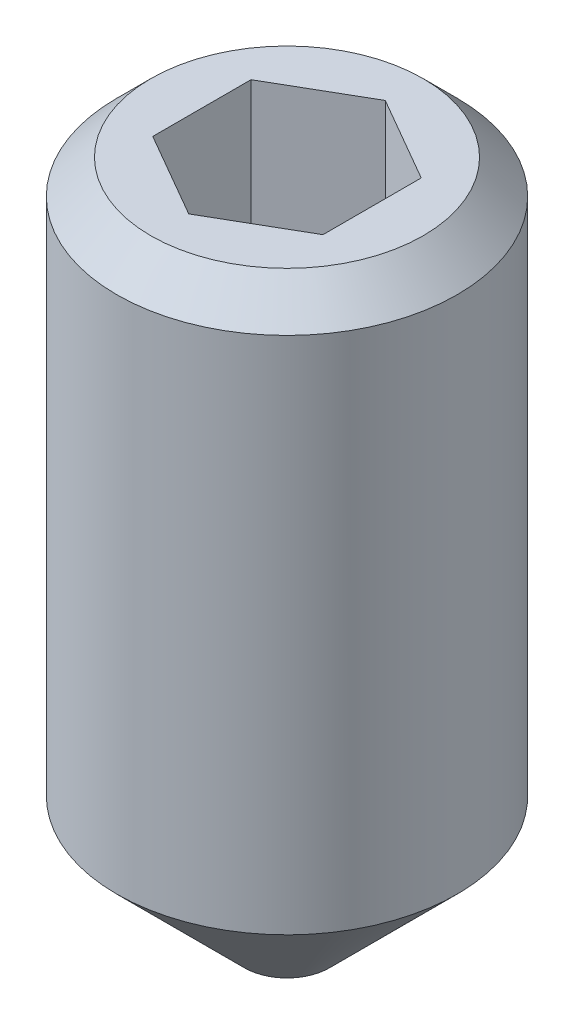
from build123d import *

# Parameters (mm, degrees)
ESQUISSE1_W             = 4
ESQUISSE1_H             = 16
CHANFREIN1_SIZE         = 3
CHANFREIN2_SIZE         = 0.8
ENL_V_MAT_EXTRU_1_DEPTH = 5


with BuildPart() as part:
    # Esquisse1 → Base-R_volution (revolve)
    with BuildSketch(Plane.XY, mode=Mode.PRIVATE) as base_r_volution_sk:
        with Locations((2, -8)):
            Rectangle(ESQUISSE1_W, ESQUISSE1_H)
    revolve(base_r_volution_sk.sketch.rotate(Axis((0, 0, 0), (0, -1, 0)), 90), axis=Axis((0, 0, 0), (0, -1, 0)))

    # Chanfrein1
    chanfrein1_edges = [part.edges().sort_by_distance(p)[0] for p in [
        (0, -16, -4),
    ]]
    chamfer(chanfrein1_edges, length=CHANFREIN1_SIZE)

    # Chanfrein2
    chanfrein2_edges = [part.edges().sort_by_distance(p)[0] for p in [
        (0, 0, -4),
    ]]
    chamfer(chanfrein2_edges, length=CHANFREIN2_SIZE)

    # Esquisse4 → Enl_v. mat.-Extru.1 (cut)
    with BuildSketch(Plane(origin=(0, 0, 0), x_dir=(-1, 0, 0), z_dir=(0, 1, 0))):
        Polygon((0, 2.309401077), (-2, 1.154700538), (-2, -1.154700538), (0, -2.309401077), (2, -1.154700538), (2, 1.154700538), align=None)
    extrude(amount=-ENL_V_MAT_EXTRU_1_DEPTH, mode=Mode.SUBTRACT)


solid = part.part
